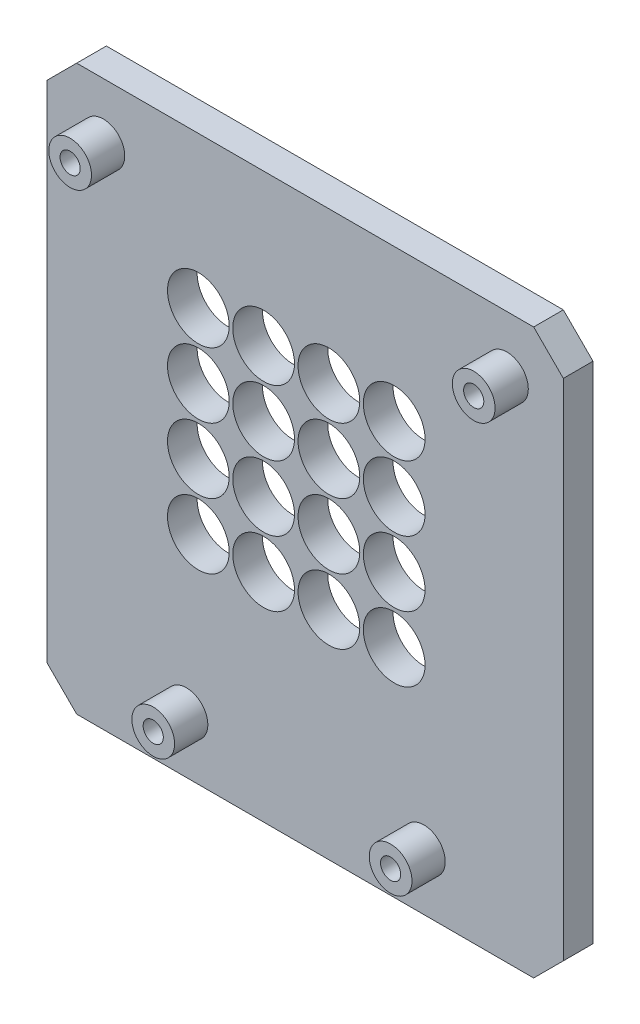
from build123d import *

# Parameters (mm, degrees)
SKETCH_1_R                   = 5.2
SKETCH_1_R_2                 = 1.7
GUIDE_16_BORES_PITCH11_DEPTH = 5
PCB_FRONT_DATUM_10P6_START   = 5
SKETCH_2_R                   = 3.6
SKETCH_2_R_2                 = 1.7
PCB_FRONT_DATUM_10P6_DEPTH   = 5.6


with BuildPart() as part:
    # Sketch 1 → Guide_16_bores_pitch11 (new body)
    with BuildSketch(Plane.XY):
        Polygon((-37, -53), (40, -53), (45, -48), (45, 37), (40, 42), (-37, 42), (-42, 37), (-42, -48), align=None)
        with Locations((-16.5, -16.5)):
            Circle(SKETCH_1_R, mode=Mode.SUBTRACT)
        with Locations((-5.5, -16.5)):
            Circle(SKETCH_1_R, mode=Mode.SUBTRACT)
        with Locations((5.5, -16.5)):
            Circle(SKETCH_1_R, mode=Mode.SUBTRACT)
        with Locations((16.5, -16.5)):
            Circle(SKETCH_1_R, mode=Mode.SUBTRACT)
        with Locations((-16.5, -5.5)):
            Circle(SKETCH_1_R, mode=Mode.SUBTRACT)
        with Locations((-5.5, -5.5)):
            Circle(SKETCH_1_R, mode=Mode.SUBTRACT)
        with Locations((5.5, -5.5)):
            Circle(SKETCH_1_R, mode=Mode.SUBTRACT)
        with Locations((16.5, -5.5)):
            Circle(SKETCH_1_R, mode=Mode.SUBTRACT)
        with Locations((-16.5, 5.5)):
            Circle(SKETCH_1_R, mode=Mode.SUBTRACT)
        with Locations((-5.5, 5.5)):
            Circle(SKETCH_1_R, mode=Mode.SUBTRACT)
        with Locations((5.5, 5.5)):
            Circle(SKETCH_1_R, mode=Mode.SUBTRACT)
        with Locations((16.5, 5.5)):
            Circle(SKETCH_1_R, mode=Mode.SUBTRACT)
        with Locations((-16.5, 16.5)):
            Circle(SKETCH_1_R, mode=Mode.SUBTRACT)
        with Locations((-5.5, 16.5)):
            Circle(SKETCH_1_R, mode=Mode.SUBTRACT)
        with Locations((5.5, 16.5)):
            Circle(SKETCH_1_R, mode=Mode.SUBTRACT)
        with Locations((16.5, 16.5)):
            Circle(SKETCH_1_R, mode=Mode.SUBTRACT)
        with Locations((-32.5, 32.5)):
            Circle(SKETCH_1_R_2, mode=Mode.SUBTRACT)
        with Locations((35.5, 32.5)):
            Circle(SKETCH_1_R_2, mode=Mode.SUBTRACT)
        with Locations((-18.5, -43.5)):
            Circle(SKETCH_1_R_2, mode=Mode.SUBTRACT)
        with Locations((21.5, -43.5)):
            Circle(SKETCH_1_R_2, mode=Mode.SUBTRACT)
    extrude(amount=GUIDE_16_BORES_PITCH11_DEPTH)

    # Sketch 2 → PCB_front_datum_10p6 (add)
    # profile 1 of 4: a face of its own
    with BuildSketch(Plane.XY.offset(PCB_FRONT_DATUM_10P6_START)):
        with Locations((-32.5, 32.5)):
            Circle(SKETCH_2_R)
        with Locations((-32.5, 32.5)):
            Circle(SKETCH_2_R_2, mode=Mode.SUBTRACT)
    # profile 2 of 4: a face of its own
    with BuildSketch(Plane.XY.offset(PCB_FRONT_DATUM_10P6_START)):
        with Locations((35.5, 32.5)):
            Circle(SKETCH_2_R)
        with Locations((35.5, 32.5)):
            Circle(SKETCH_2_R_2, mode=Mode.SUBTRACT)
    # profile 3 of 4: a face of its own
    with BuildSketch(Plane.XY.offset(PCB_FRONT_DATUM_10P6_START)):
        with Locations((-18.5, -43.5)):
            Circle(SKETCH_2_R)
        with Locations((-18.5, -43.5)):
            Circle(SKETCH_2_R_2, mode=Mode.SUBTRACT)
    # profile 4 of 4: a face of its own
    with BuildSketch(Plane.XY.offset(PCB_FRONT_DATUM_10P6_START)):
        with Locations((21.5, -43.5)):
            Circle(SKETCH_2_R)
        with Locations((21.5, -43.5)):
            Circle(SKETCH_2_R_2, mode=Mode.SUBTRACT)
    extrude(amount=PCB_FRONT_DATUM_10P6_DEPTH)


solid = part.part
